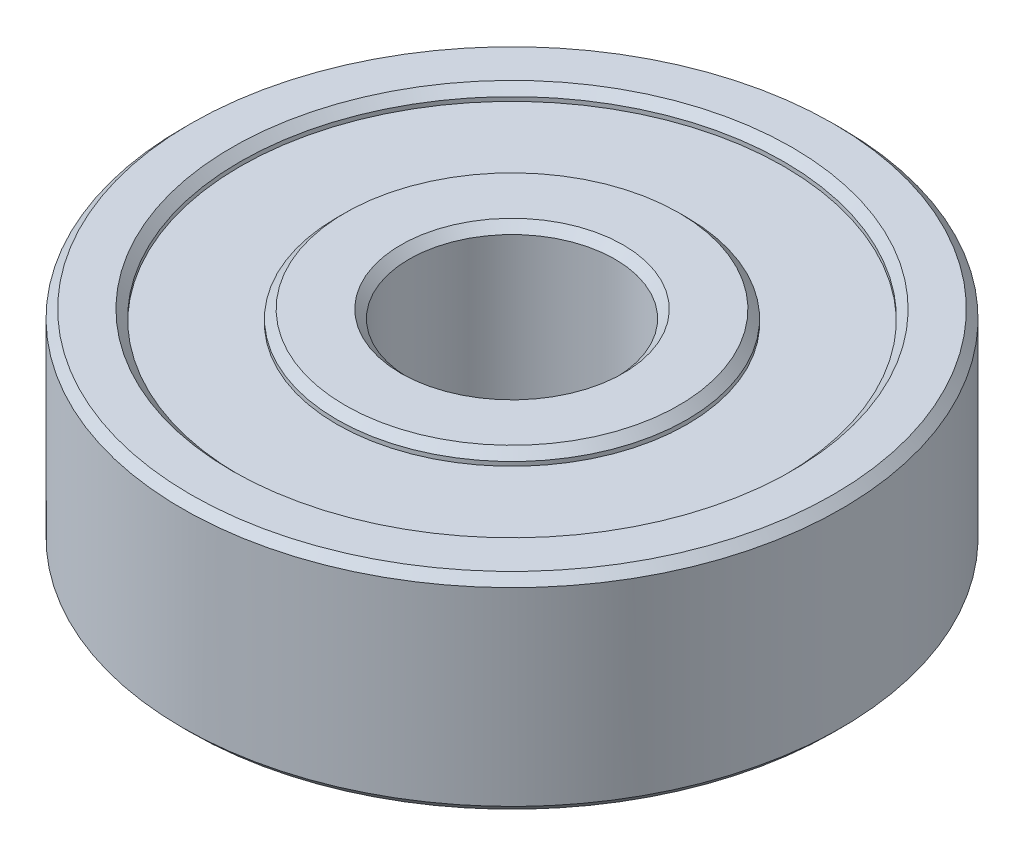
ISO-10303-21;
HEADER;
FILE_DESCRIPTION(('STEP AP214'),'2;1');
FILE_NAME('part.step','',(''),(''),'','','');
FILE_SCHEMA(('AUTOMOTIVE_DESIGN { 1 0 10303 214 1 1 1 1 }'));
ENDSEC;
DATA;
#1=APPLICATION_CONTEXT('core data for automotive mechanical design processes');
#2=APPLICATION_PROTOCOL_DEFINITION('international standard','automotive_design',2000,#1);
#3=PRODUCT_CONTEXT('',#1,'mechanical');
#4=PRODUCT('Part','Part','',(#3));
#5=PRODUCT_RELATED_PRODUCT_CATEGORY('part','',(#4));
#6=PRODUCT_DEFINITION_FORMATION('','',#4);
#7=PRODUCT_DEFINITION_CONTEXT('part definition',#1,'design');
#8=PRODUCT_DEFINITION('design','',#6,#7);
#9=PRODUCT_DEFINITION_SHAPE('','',#8);
#10=(LENGTH_UNIT() NAMED_UNIT(*) SI_UNIT(.MILLI.,.METRE.));
#11=(NAMED_UNIT(*) PLANE_ANGLE_UNIT() SI_UNIT($,.RADIAN.));
#12=(NAMED_UNIT(*) SI_UNIT($,.STERADIAN.) SOLID_ANGLE_UNIT());
#13=UNCERTAINTY_MEASURE_WITH_UNIT(LENGTH_MEASURE(1.E-05),#10,'distance_accuracy_value','');
#14=(GEOMETRIC_REPRESENTATION_CONTEXT(3) GLOBAL_UNCERTAINTY_ASSIGNED_CONTEXT((#13)) GLOBAL_UNIT_ASSIGNED_CONTEXT((#10,
#11,#12)) REPRESENTATION_CONTEXT('',''));
#15=CARTESIAN_POINT('',(0.,0.,0.));
#16=DIRECTION('',(0.,0.,1.));
#17=DIRECTION('',(1.,0.,0.));
#18=AXIS2_PLACEMENT_3D('',#15,#16,#17);
#19=CARTESIAN_POINT('',(0.,0.2,0.));
#20=DIRECTION('',(0.,1.,0.));
#21=DIRECTION('',(0.,0.,1.));
#22=AXIS2_PLACEMENT_3D('',#19,#20,#21);
#23=CYLINDRICAL_SURFACE('',#22,2.5);
#24=CARTESIAN_POINT('',(0.,4.79999999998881,0.));
#25=DIRECTION('',(0.,1.,0.));
#26=DIRECTION('',(0.,0.,1.));
#27=AXIS2_PLACEMENT_3D('',#24,#25,#26);
#28=CIRCLE('',#27,2.49999999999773);
#29=CARTESIAN_POINT('',(0.,4.79999999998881,2.49999999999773));
#30=VERTEX_POINT('',#29);
#31=EDGE_CURVE('E55',#30,#30,#28,.T.);
#32=ORIENTED_EDGE('',*,*,#31,.T.);
#33=EDGE_LOOP('',(#32));
#34=FACE_BOUND('',#33,.T.);
#35=CARTESIAN_POINT('',(0.,0.200000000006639,0.));
#36=DIRECTION('',(0.,-1.,0.));
#37=DIRECTION('',(0.,0.,-1.));
#38=AXIS2_PLACEMENT_3D('',#35,#36,#37);
#39=CIRCLE('',#38,2.50000000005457);
#40=CARTESIAN_POINT('',(0.,0.200000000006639,-2.50000000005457));
#41=VERTEX_POINT('',#40);
#42=EDGE_CURVE('E52',#41,#41,#39,.T.);
#43=ORIENTED_EDGE('',*,*,#42,.T.);
#44=EDGE_LOOP('',(#43));
#45=FACE_BOUND('',#44,.T.);
#46=ADVANCED_FACE('F15',(#34,#45),#23,.F.);
#47=CARTESIAN_POINT('',(0.,4.99999999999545,0.));
#48=DIRECTION('',(0.,1.,0.));
#49=DIRECTION('',(0.,0.,1.));
#50=AXIS2_PLACEMENT_3D('',#47,#48,#49);
#51=CONICAL_SURFACE('',#50,2.70000000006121,0.785398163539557);
#52=CARTESIAN_POINT('',(0.,4.99999999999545,0.));
#53=DIRECTION('',(0.,1.,0.));
#54=DIRECTION('',(0.,0.,1.));
#55=AXIS2_PLACEMENT_3D('',#52,#53,#54);
#56=CIRCLE('',#55,2.70000000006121);
#57=CARTESIAN_POINT('',(0.,4.99999999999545,2.70000000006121));
#58=VERTEX_POINT('',#57);
#59=EDGE_CURVE('E18',#58,#58,#56,.F.);
#60=ORIENTED_EDGE('',*,*,#59,.F.);
#61=EDGE_LOOP('',(#60));
#62=FACE_BOUND('',#61,.T.);
#63=ORIENTED_EDGE('',*,*,#31,.F.);
#64=EDGE_LOOP('',(#63));
#65=FACE_BOUND('',#64,.T.);
#66=ADVANCED_FACE('F94',(#62,#65),#51,.F.);
#67=CARTESIAN_POINT('',(0.,0.,0.));
#68=DIRECTION('',(0.,-1.,0.));
#69=DIRECTION('',(0.,0.,-1.));
#70=AXIS2_PLACEMENT_3D('',#67,#68,#69);
#71=CONICAL_SURFACE('',#70,2.70000000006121,0.785398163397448);
#72=CARTESIAN_POINT('',(0.,0.,0.));
#73=DIRECTION('',(0.,-1.,0.));
#74=DIRECTION('',(0.,0.,-1.));
#75=AXIS2_PLACEMENT_3D('',#72,#73,#74);
#76=CIRCLE('',#75,2.70000000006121);
#77=CARTESIAN_POINT('',(0.,0.,-2.70000000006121));
#78=VERTEX_POINT('',#77);
#79=EDGE_CURVE('E84',#78,#78,#76,.F.);
#80=ORIENTED_EDGE('',*,*,#79,.F.);
#81=EDGE_LOOP('',(#80));
#82=FACE_BOUND('',#81,.T.);
#83=ORIENTED_EDGE('',*,*,#42,.F.);
#84=EDGE_LOOP('',(#83));
#85=FACE_BOUND('',#84,.T.);
#86=ADVANCED_FACE('F97',(#82,#85),#71,.F.);
#87=CARTESIAN_POINT('',(-4.051,5.,4.051));
#88=DIRECTION('',(0.,1.,0.));
#89=DIRECTION('',(0.,0.,1.));
#90=AXIS2_PLACEMENT_3D('',#87,#88,#89);
#91=PLANE('',#90);
#92=ORIENTED_EDGE('',*,*,#59,.T.);
#93=EDGE_LOOP('',(#92));
#94=FACE_BOUND('',#93,.T.);
#95=CARTESIAN_POINT('',(0.,4.99999999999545,0.));
#96=DIRECTION('',(0.,-1.,0.));
#97=DIRECTION('',(0.,0.,-1.));
#98=AXIS2_PLACEMENT_3D('',#95,#96,#97);
#99=CIRCLE('',#98,4.05000000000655);
#100=CARTESIAN_POINT('',(0.,4.99999999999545,-4.05000000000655));
#101=VERTEX_POINT('',#100);
#102=EDGE_CURVE('E82',#101,#101,#99,.T.);
#103=ORIENTED_EDGE('',*,*,#102,.F.);
#104=EDGE_LOOP('',(#103));
#105=FACE_BOUND('',#104,.T.);
#106=ADVANCED_FACE('F91',(#94,#105),#91,.T.);
#107=CARTESIAN_POINT('',(4.051,0.,4.051));
#108=DIRECTION('',(0.,-1.,0.));
#109=DIRECTION('',(0.,0.,-1.));
#110=AXIS2_PLACEMENT_3D('',#107,#108,#109);
#111=PLANE('',#110);
#112=ORIENTED_EDGE('',*,*,#79,.T.);
#113=EDGE_LOOP('',(#112));
#114=FACE_BOUND('',#113,.T.);
#115=CARTESIAN_POINT('',(0.,-1.13686837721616E-10,0.));
#116=DIRECTION('',(0.,1.,0.));
#117=DIRECTION('',(0.,0.,1.));
#118=AXIS2_PLACEMENT_3D('',#115,#116,#117);
#119=CIRCLE('',#118,4.0499999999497);
#120=CARTESIAN_POINT('',(0.,-1.13686837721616E-10,4.0499999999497));
#121=VERTEX_POINT('',#120);
#122=EDGE_CURVE('E49',#121,#121,#119,.T.);
#123=ORIENTED_EDGE('',*,*,#122,.F.);
#124=EDGE_LOOP('',(#123));
#125=FACE_BOUND('',#124,.T.);
#126=ADVANCED_FACE('F111',(#114,#125),#111,.T.);
#127=CARTESIAN_POINT('',(0.,4.8000000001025,0.));
#128=DIRECTION('',(0.,-1.,0.));
#129=DIRECTION('',(0.,0.,-1.));
#130=AXIS2_PLACEMENT_3D('',#127,#128,#129);
#131=CONICAL_SURFACE('',#130,4.2499999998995,0.785398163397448);
#132=ORIENTED_EDGE('',*,*,#102,.T.);
#133=EDGE_LOOP('',(#132));
#134=FACE_BOUND('',#133,.T.);
#135=CARTESIAN_POINT('',(0.,4.8,0.));
#136=DIRECTION('',(0.,-1.,0.));
#137=DIRECTION('',(0.,0.,-1.));
#138=AXIS2_PLACEMENT_3D('',#135,#136,#137);
#139=CIRCLE('',#138,4.25);
#140=CARTESIAN_POINT('',(0.,4.8,-4.25));
#141=VERTEX_POINT('',#140);
#142=EDGE_CURVE('E46',#141,#141,#139,.T.);
#143=ORIENTED_EDGE('',*,*,#142,.F.);
#144=EDGE_LOOP('',(#143));
#145=FACE_BOUND('',#144,.T.);
#146=ADVANCED_FACE('F171',(#134,#145),#131,.T.);
#147=CARTESIAN_POINT('',(0.,0.199999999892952,0.));
#148=DIRECTION('',(0.,1.,0.));
#149=DIRECTION('',(0.,0.,1.));
#150=AXIS2_PLACEMENT_3D('',#147,#148,#149);
#151=CONICAL_SURFACE('',#150,4.24999999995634,0.785398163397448);
#152=ORIENTED_EDGE('',*,*,#122,.T.);
#153=EDGE_LOOP('',(#152));
#154=FACE_BOUND('',#153,.T.);
#155=CARTESIAN_POINT('',(0.,0.2,0.));
#156=DIRECTION('',(0.,-1.,0.));
#157=DIRECTION('',(0.,0.,-1.));
#158=AXIS2_PLACEMENT_3D('',#155,#156,#157);
#159=CIRCLE('',#158,4.25);
#160=CARTESIAN_POINT('',(0.,0.2,-4.25));
#161=VERTEX_POINT('',#160);
#162=EDGE_CURVE('E42',#161,#161,#159,.F.);
#163=ORIENTED_EDGE('',*,*,#162,.F.);
#164=EDGE_LOOP('',(#163));
#165=FACE_BOUND('',#164,.T.);
#166=ADVANCED_FACE('F167',(#154,#165),#151,.T.);
#167=CARTESIAN_POINT('',(0.,4.8,0.));
#168=DIRECTION('',(0.,-1.,0.));
#169=DIRECTION('',(0.,0.,-1.));
#170=AXIS2_PLACEMENT_3D('',#167,#168,#169);
#171=CYLINDRICAL_SURFACE('',#170,4.25);
#172=ORIENTED_EDGE('',*,*,#142,.T.);
#173=EDGE_LOOP('',(#172));
#174=FACE_BOUND('',#173,.T.);
#175=CARTESIAN_POINT('',(0.,4.7,0.));
#176=DIRECTION('',(0.,-1.,0.));
#177=DIRECTION('',(0.,0.,-1.));
#178=AXIS2_PLACEMENT_3D('',#175,#176,#177);
#179=CIRCLE('',#178,4.25);
#180=CARTESIAN_POINT('',(0.,4.7,-4.25));
#181=VERTEX_POINT('',#180);
#182=EDGE_CURVE('E45',#181,#181,#179,.T.);
#183=ORIENTED_EDGE('',*,*,#182,.F.);
#184=EDGE_LOOP('',(#183));
#185=FACE_BOUND('',#184,.T.);
#186=ADVANCED_FACE('F163',(#174,#185),#171,.T.);
#187=CARTESIAN_POINT('',(0.,0.3,0.));
#188=DIRECTION('',(0.,-1.,0.));
#189=DIRECTION('',(0.,0.,-1.));
#190=AXIS2_PLACEMENT_3D('',#187,#188,#189);
#191=CYLINDRICAL_SURFACE('',#190,4.25);
#192=CARTESIAN_POINT('',(0.,0.3,0.));
#193=DIRECTION('',(0.,-1.,0.));
#194=DIRECTION('',(0.,0.,-1.));
#195=AXIS2_PLACEMENT_3D('',#192,#193,#194);
#196=CIRCLE('',#195,4.25);
#197=CARTESIAN_POINT('',(0.,0.3,-4.25));
#198=VERTEX_POINT('',#197);
#199=EDGE_CURVE('E75',#198,#198,#196,.F.);
#200=ORIENTED_EDGE('',*,*,#199,.F.);
#201=EDGE_LOOP('',(#200));
#202=FACE_BOUND('',#201,.T.);
#203=ORIENTED_EDGE('',*,*,#162,.T.);
#204=EDGE_LOOP('',(#203));
#205=FACE_BOUND('',#204,.T.);
#206=ADVANCED_FACE('F159',(#202,#205),#191,.T.);
#207=CARTESIAN_POINT('',(-6.601,4.7,6.601));
#208=DIRECTION('',(0.,1.,0.));
#209=DIRECTION('',(0.,0.,1.));
#210=AXIS2_PLACEMENT_3D('',#207,#208,#209);
#211=PLANE('',#210);
#212=ORIENTED_EDGE('',*,*,#182,.T.);
#213=EDGE_LOOP('',(#212));
#214=FACE_BOUND('',#213,.T.);
#215=CARTESIAN_POINT('',(0.,4.7,0.));
#216=DIRECTION('',(0.,1.,0.));
#217=DIRECTION('',(0.,0.,1.));
#218=AXIS2_PLACEMENT_3D('',#215,#216,#217);
#219=CIRCLE('',#218,6.6);
#220=CARTESIAN_POINT('',(0.,4.7,6.6));
#221=VERTEX_POINT('',#220);
#222=EDGE_CURVE('E72',#221,#221,#219,.T.);
#223=ORIENTED_EDGE('',*,*,#222,.T.);
#224=EDGE_LOOP('',(#223));
#225=FACE_BOUND('',#224,.T.);
#226=ADVANCED_FACE('F155',(#214,#225),#211,.T.);
#227=CARTESIAN_POINT('',(6.601,0.3,6.601));
#228=DIRECTION('',(0.,-1.,0.));
#229=DIRECTION('',(0.,0.,-1.));
#230=AXIS2_PLACEMENT_3D('',#227,#228,#229);
#231=PLANE('',#230);
#232=ORIENTED_EDGE('',*,*,#199,.T.);
#233=EDGE_LOOP('',(#232));
#234=FACE_BOUND('',#233,.T.);
#235=CARTESIAN_POINT('',(0.,0.3,0.));
#236=DIRECTION('',(0.,1.,0.));
#237=DIRECTION('',(0.,0.,1.));
#238=AXIS2_PLACEMENT_3D('',#235,#236,#237);
#239=CIRCLE('',#238,6.6);
#240=CARTESIAN_POINT('',(0.,0.3,6.6));
#241=VERTEX_POINT('',#240);
#242=EDGE_CURVE('E39',#241,#241,#239,.F.);
#243=ORIENTED_EDGE('',*,*,#242,.T.);
#244=EDGE_LOOP('',(#243));
#245=FACE_BOUND('',#244,.T.);
#246=ADVANCED_FACE('F151',(#234,#245),#231,.T.);
#247=CARTESIAN_POINT('',(0.,4.7,0.));
#248=DIRECTION('',(0.,1.,0.));
#249=DIRECTION('',(0.,0.,1.));
#250=AXIS2_PLACEMENT_3D('',#247,#248,#249);
#251=CYLINDRICAL_SURFACE('',#250,6.6);
#252=CARTESIAN_POINT('',(0.,4.79999999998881,0.));
#253=DIRECTION('',(0.,1.,0.));
#254=DIRECTION('',(0.,0.,1.));
#255=AXIS2_PLACEMENT_3D('',#252,#253,#254);
#256=CIRCLE('',#255,6.59999999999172);
#257=CARTESIAN_POINT('',(0.,4.79999999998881,6.59999999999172));
#258=VERTEX_POINT('',#257);
#259=EDGE_CURVE('E36',#258,#258,#256,.T.);
#260=ORIENTED_EDGE('',*,*,#259,.T.);
#261=EDGE_LOOP('',(#260));
#262=FACE_BOUND('',#261,.T.);
#263=ORIENTED_EDGE('',*,*,#222,.F.);
#264=EDGE_LOOP('',(#263));
#265=FACE_BOUND('',#264,.T.);
#266=ADVANCED_FACE('F147',(#262,#265),#251,.F.);
#267=CARTESIAN_POINT('',(0.,0.2,0.));
#268=DIRECTION('',(0.,1.,0.));
#269=DIRECTION('',(0.,0.,1.));
#270=AXIS2_PLACEMENT_3D('',#267,#268,#269);
#271=CYLINDRICAL_SURFACE('',#270,6.6);
#272=ORIENTED_EDGE('',*,*,#242,.F.);
#273=EDGE_LOOP('',(#272));
#274=FACE_BOUND('',#273,.T.);
#275=CARTESIAN_POINT('',(0.,0.199999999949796,0.));
#276=DIRECTION('',(0.,-1.,0.));
#277=DIRECTION('',(0.,0.,-1.));
#278=AXIS2_PLACEMENT_3D('',#275,#276,#277);
#279=CIRCLE('',#278,6.59999999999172);
#280=CARTESIAN_POINT('',(0.,0.199999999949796,-6.59999999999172));
#281=VERTEX_POINT('',#280);
#282=EDGE_CURVE('E32',#281,#281,#279,.T.);
#283=ORIENTED_EDGE('',*,*,#282,.T.);
#284=EDGE_LOOP('',(#283));
#285=FACE_BOUND('',#284,.T.);
#286=ADVANCED_FACE('F143',(#274,#285),#271,.F.);
#287=CARTESIAN_POINT('',(0.,5.0000000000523,0.));
#288=DIRECTION('',(0.,1.,0.));
#289=DIRECTION('',(0.,0.,1.));
#290=AXIS2_PLACEMENT_3D('',#287,#288,#289);
#291=CONICAL_SURFACE('',#290,6.79999999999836,0.78539816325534);
#292=CARTESIAN_POINT('',(0.,5.0000000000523,0.));
#293=DIRECTION('',(0.,1.,0.));
#294=DIRECTION('',(0.,0.,1.));
#295=AXIS2_PLACEMENT_3D('',#292,#293,#294);
#296=CIRCLE('',#295,6.79999999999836);
#297=CARTESIAN_POINT('',(0.,5.0000000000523,6.79999999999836));
#298=VERTEX_POINT('',#297);
#299=EDGE_CURVE('E35',#298,#298,#296,.F.);
#300=ORIENTED_EDGE('',*,*,#299,.F.);
#301=EDGE_LOOP('',(#300));
#302=FACE_BOUND('',#301,.T.);
#303=ORIENTED_EDGE('',*,*,#259,.F.);
#304=EDGE_LOOP('',(#303));
#305=FACE_BOUND('',#304,.T.);
#306=ADVANCED_FACE('F139',(#302,#305),#291,.F.);
#307=CARTESIAN_POINT('',(0.,-5.6843418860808E-11,0.));
#308=DIRECTION('',(0.,-1.,0.));
#309=DIRECTION('',(0.,0.,-1.));
#310=AXIS2_PLACEMENT_3D('',#307,#308,#309);
#311=CONICAL_SURFACE('',#310,6.80000000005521,0.785398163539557);
#312=CARTESIAN_POINT('',(0.,0.,0.));
#313=DIRECTION('',(0.,-1.,0.));
#314=DIRECTION('',(0.,0.,-1.));
#315=AXIS2_PLACEMENT_3D('',#312,#313,#314);
#316=CIRCLE('',#315,6.79999999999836);
#317=CARTESIAN_POINT('',(0.,0.,-6.79999999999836));
#318=VERTEX_POINT('',#317);
#319=EDGE_CURVE('E65',#318,#318,#316,.F.);
#320=ORIENTED_EDGE('',*,*,#319,.F.);
#321=EDGE_LOOP('',(#320));
#322=FACE_BOUND('',#321,.T.);
#323=ORIENTED_EDGE('',*,*,#282,.F.);
#324=EDGE_LOOP('',(#323));
#325=FACE_BOUND('',#324,.T.);
#326=ADVANCED_FACE('F135',(#322,#325),#311,.F.);
#327=CARTESIAN_POINT('',(-7.801,5.,7.801));
#328=DIRECTION('',(0.,1.,0.));
#329=DIRECTION('',(0.,0.,1.));
#330=AXIS2_PLACEMENT_3D('',#327,#328,#329);
#331=PLANE('',#330);
#332=ORIENTED_EDGE('',*,*,#299,.T.);
#333=EDGE_LOOP('',(#332));
#334=FACE_BOUND('',#333,.T.);
#335=CARTESIAN_POINT('',(0.,5.,0.));
#336=DIRECTION('',(0.,-1.,0.));
#337=DIRECTION('',(0.,0.,-1.));
#338=AXIS2_PLACEMENT_3D('',#335,#336,#337);
#339=CIRCLE('',#338,7.8);
#340=CARTESIAN_POINT('',(0.,5.,-7.8));
#341=VERTEX_POINT('',#340);
#342=EDGE_CURVE('E62',#341,#341,#339,.T.);
#343=ORIENTED_EDGE('',*,*,#342,.F.);
#344=EDGE_LOOP('',(#343));
#345=FACE_BOUND('',#344,.T.);
#346=ADVANCED_FACE('F131',(#334,#345),#331,.T.);
#347=CARTESIAN_POINT('',(7.801,0.,7.801));
#348=DIRECTION('',(0.,-1.,0.));
#349=DIRECTION('',(0.,0.,-1.));
#350=AXIS2_PLACEMENT_3D('',#347,#348,#349);
#351=PLANE('',#350);
#352=ORIENTED_EDGE('',*,*,#319,.T.);
#353=EDGE_LOOP('',(#352));
#354=FACE_BOUND('',#353,.T.);
#355=CARTESIAN_POINT('',(0.,0.,0.));
#356=DIRECTION('',(0.,1.,0.));
#357=DIRECTION('',(0.,0.,1.));
#358=AXIS2_PLACEMENT_3D('',#355,#356,#357);
#359=CIRCLE('',#358,7.8);
#360=CARTESIAN_POINT('',(0.,0.,7.8));
#361=VERTEX_POINT('',#360);
#362=EDGE_CURVE('E27',#361,#361,#359,.T.);
#363=ORIENTED_EDGE('',*,*,#362,.F.);
#364=EDGE_LOOP('',(#363));
#365=FACE_BOUND('',#364,.T.);
#366=ADVANCED_FACE('F127',(#354,#365),#351,.T.);
#367=CARTESIAN_POINT('',(0.,4.8,0.));
#368=DIRECTION('',(0.,-1.,0.));
#369=DIRECTION('',(0.,0.,-1.));
#370=AXIS2_PLACEMENT_3D('',#367,#368,#369);
#371=CONICAL_SURFACE('',#370,8.,0.785398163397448);
#372=ORIENTED_EDGE('',*,*,#342,.T.);
#373=EDGE_LOOP('',(#372));
#374=FACE_BOUND('',#373,.T.);
#375=CARTESIAN_POINT('',(0.,4.8,0.));
#376=DIRECTION('',(0.,-1.,0.));
#377=DIRECTION('',(0.,0.,-1.));
#378=AXIS2_PLACEMENT_3D('',#375,#376,#377);
#379=CIRCLE('',#378,8.);
#380=CARTESIAN_POINT('',(0.,4.8,-8.));
#381=VERTEX_POINT('',#380);
#382=EDGE_CURVE('E10',#381,#381,#379,.T.);
#383=ORIENTED_EDGE('',*,*,#382,.F.);
#384=EDGE_LOOP('',(#383));
#385=FACE_BOUND('',#384,.T.);
#386=ADVANCED_FACE('F120',(#374,#385),#371,.T.);
#387=CARTESIAN_POINT('',(0.,0.2,0.));
#388=DIRECTION('',(0.,1.,0.));
#389=DIRECTION('',(0.,0.,1.));
#390=AXIS2_PLACEMENT_3D('',#387,#388,#389);
#391=CONICAL_SURFACE('',#390,8.,0.78539816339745);
#392=ORIENTED_EDGE('',*,*,#362,.T.);
#393=EDGE_LOOP('',(#392));
#394=FACE_BOUND('',#393,.T.);
#395=CARTESIAN_POINT('',(0.,0.2,0.));
#396=DIRECTION('',(0.,-1.,0.));
#397=DIRECTION('',(0.,0.,-1.));
#398=AXIS2_PLACEMENT_3D('',#395,#396,#397);
#399=CIRCLE('',#398,8.);
#400=CARTESIAN_POINT('',(0.,0.2,-8.));
#401=VERTEX_POINT('',#400);
#402=EDGE_CURVE('E22',#401,#401,#399,.F.);
#403=ORIENTED_EDGE('',*,*,#402,.F.);
#404=EDGE_LOOP('',(#403));
#405=FACE_BOUND('',#404,.T.);
#406=ADVANCED_FACE('F115',(#394,#405),#391,.T.);
#407=CARTESIAN_POINT('',(0.,4.8,0.));
#408=DIRECTION('',(0.,-1.,0.));
#409=DIRECTION('',(0.,0.,-1.));
#410=AXIS2_PLACEMENT_3D('',#407,#408,#409);
#411=CYLINDRICAL_SURFACE('',#410,8.);
#412=ORIENTED_EDGE('',*,*,#382,.T.);
#413=EDGE_LOOP('',(#412));
#414=FACE_BOUND('',#413,.T.);
#415=ORIENTED_EDGE('',*,*,#402,.T.);
#416=EDGE_LOOP('',(#415));
#417=FACE_BOUND('',#416,.T.);
#418=ADVANCED_FACE('F113',(#414,#417),#411,.T.);
#419=CLOSED_SHELL('',(#46,#66,#86,#106,#126,#146,#166,#186,#206,#226,#246,#266,#286,#306,#326,
#346,#366,#386,#406,#418));
#420=MANIFOLD_SOLID_BREP('B1',#419);
#421=ADVANCED_BREP_SHAPE_REPRESENTATION('',(#18,#420),#14);
#422=SHAPE_DEFINITION_REPRESENTATION(#9,#421);
ENDSEC;
END-ISO-10303-21;
